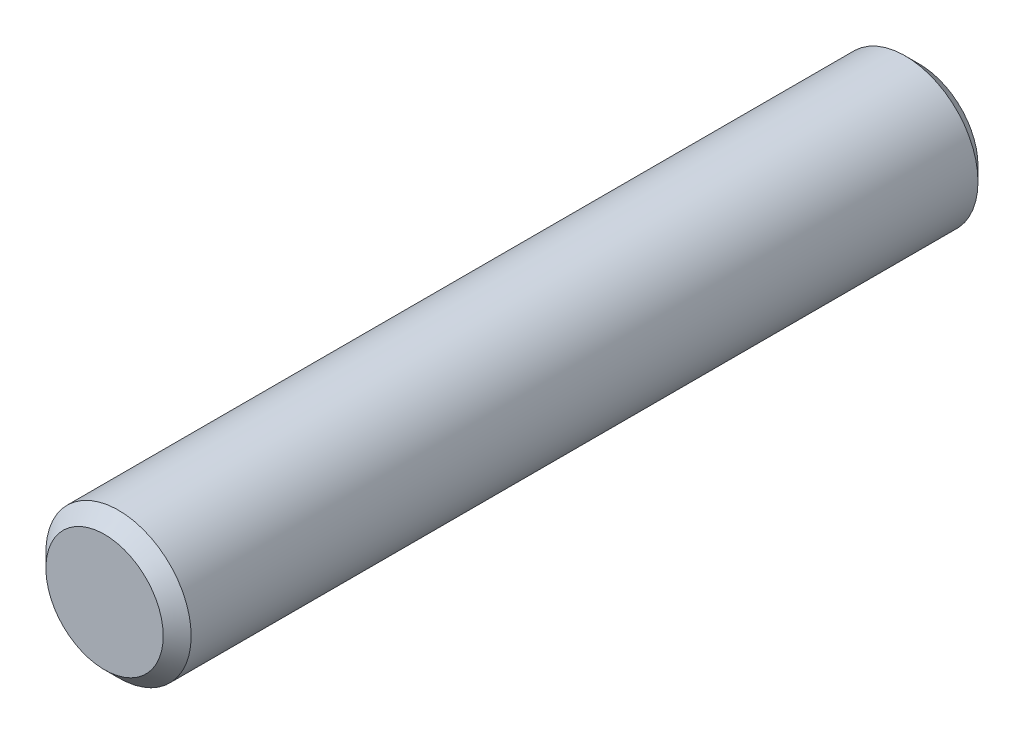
ISO-10303-21;
HEADER;
FILE_DESCRIPTION(('STEP AP214'),'2;1');
FILE_NAME('part.step','',(''),(''),'','','');
FILE_SCHEMA(('AUTOMOTIVE_DESIGN { 1 0 10303 214 1 1 1 1 }'));
ENDSEC;
DATA;
#1=APPLICATION_CONTEXT('core data for automotive mechanical design processes');
#2=APPLICATION_PROTOCOL_DEFINITION('international standard','automotive_design',2000,#1);
#3=PRODUCT_CONTEXT('',#1,'mechanical');
#4=PRODUCT('Part','Part','',(#3));
#5=PRODUCT_RELATED_PRODUCT_CATEGORY('part','',(#4));
#6=PRODUCT_DEFINITION_FORMATION('','',#4);
#7=PRODUCT_DEFINITION_CONTEXT('part definition',#1,'design');
#8=PRODUCT_DEFINITION('design','',#6,#7);
#9=PRODUCT_DEFINITION_SHAPE('','',#8);
#10=(LENGTH_UNIT() NAMED_UNIT(*) SI_UNIT(.MILLI.,.METRE.));
#11=(NAMED_UNIT(*) PLANE_ANGLE_UNIT() SI_UNIT($,.RADIAN.));
#12=(NAMED_UNIT(*) SI_UNIT($,.STERADIAN.) SOLID_ANGLE_UNIT());
#13=UNCERTAINTY_MEASURE_WITH_UNIT(LENGTH_MEASURE(1.E-05),#10,'distance_accuracy_value','');
#14=(GEOMETRIC_REPRESENTATION_CONTEXT(3) GLOBAL_UNCERTAINTY_ASSIGNED_CONTEXT((#13)) GLOBAL_UNIT_ASSIGNED_CONTEXT((#10,
#11,#12)) REPRESENTATION_CONTEXT('',''));
#15=CARTESIAN_POINT('',(0.,0.,0.));
#16=DIRECTION('',(0.,0.,1.));
#17=DIRECTION('',(1.,0.,0.));
#18=AXIS2_PLACEMENT_3D('',#15,#16,#17);
#19=CARTESIAN_POINT('',(0.,0.,11.1125));
#20=DIRECTION('',(0.,0.,-1.));
#21=DIRECTION('',(-1.,0.,0.));
#22=AXIS2_PLACEMENT_3D('',#19,#20,#21);
#23=CYLINDRICAL_SURFACE('',#22,1.9812);
#24=CARTESIAN_POINT('',(0.,0.,-10.7315));
#25=DIRECTION('',(0.,0.,1.));
#26=DIRECTION('',(1.,0.,0.));
#27=AXIS2_PLACEMENT_3D('',#24,#25,#26);
#28=CIRCLE('',#27,1.9812);
#29=CARTESIAN_POINT('',(1.9812,0.,-10.7315));
#30=VERTEX_POINT('',#29);
#31=EDGE_CURVE('E44',#30,#30,#28,.T.);
#32=ORIENTED_EDGE('',*,*,#31,.T.);
#33=EDGE_LOOP('',(#32));
#34=FACE_BOUND('',#33,.T.);
#35=CARTESIAN_POINT('',(0.,0.,10.7315));
#36=DIRECTION('',(0.,0.,1.));
#37=DIRECTION('',(1.,0.,0.));
#38=AXIS2_PLACEMENT_3D('',#35,#36,#37);
#39=CIRCLE('',#38,1.9812);
#40=CARTESIAN_POINT('',(1.9812,0.,10.7315));
#41=VERTEX_POINT('',#40);
#42=EDGE_CURVE('E48',#41,#41,#39,.F.);
#43=ORIENTED_EDGE('',*,*,#42,.T.);
#44=EDGE_LOOP('',(#43));
#45=FACE_BOUND('',#44,.T.);
#46=ADVANCED_FACE('F33',(#34,#45),#23,.T.);
#47=CARTESIAN_POINT('',(0.,0.,11.1125));
#48=DIRECTION('',(0.,0.,1.));
#49=DIRECTION('',(1.,0.,0.));
#50=AXIS2_PLACEMENT_3D('',#47,#48,#49);
#51=PLANE('',#50);
#52=CARTESIAN_POINT('',(0.,0.,11.1125));
#53=DIRECTION('',(0.,0.,1.));
#54=DIRECTION('',(1.,0.,0.));
#55=AXIS2_PLACEMENT_3D('',#52,#53,#54);
#56=CIRCLE('',#55,1.6002);
#57=CARTESIAN_POINT('',(1.6002,0.,11.1125));
#58=VERTEX_POINT('',#57);
#59=EDGE_CURVE('E10',#58,#58,#56,.T.);
#60=ORIENTED_EDGE('',*,*,#59,.T.);
#61=EDGE_LOOP('',(#60));
#62=FACE_BOUND('',#61,.T.);
#63=ADVANCED_FACE('F64',(#62),#51,.T.);
#64=CARTESIAN_POINT('',(0.,0.,-11.1125));
#65=DIRECTION('',(0.,0.,1.));
#66=DIRECTION('',(1.,0.,0.));
#67=AXIS2_PLACEMENT_3D('',#64,#65,#66);
#68=PLANE('',#67);
#69=CARTESIAN_POINT('',(0.,0.,-11.1125));
#70=DIRECTION('',(0.,0.,1.));
#71=DIRECTION('',(1.,0.,0.));
#72=AXIS2_PLACEMENT_3D('',#69,#70,#71);
#73=CIRCLE('',#72,1.60019999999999);
#74=CARTESIAN_POINT('',(1.60019999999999,0.,-11.1125));
#75=VERTEX_POINT('',#74);
#76=EDGE_CURVE('E40',#75,#75,#73,.F.);
#77=ORIENTED_EDGE('',*,*,#76,.T.);
#78=EDGE_LOOP('',(#77));
#79=FACE_BOUND('',#78,.T.);
#80=ADVANCED_FACE('F61',(#79),#68,.F.);
#81=CARTESIAN_POINT('',(0.,0.,-10.7315));
#82=DIRECTION('',(0.,0.,1.));
#83=DIRECTION('',(1.,0.,0.));
#84=AXIS2_PLACEMENT_3D('',#81,#82,#83);
#85=CONICAL_SURFACE('',#84,1.9812,0.785398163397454);
#86=ORIENTED_EDGE('',*,*,#76,.F.);
#87=EDGE_LOOP('',(#86));
#88=FACE_BOUND('',#87,.T.);
#89=ORIENTED_EDGE('',*,*,#31,.F.);
#90=EDGE_LOOP('',(#89));
#91=FACE_BOUND('',#90,.T.);
#92=ADVANCED_FACE('F57',(#88,#91),#85,.T.);
#93=CARTESIAN_POINT('',(0.,0.,11.1125));
#94=DIRECTION('',(0.,0.,-1.));
#95=DIRECTION('',(-1.,0.,0.));
#96=AXIS2_PLACEMENT_3D('',#93,#94,#95);
#97=CONICAL_SURFACE('',#96,1.6002,0.785398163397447);
#98=ORIENTED_EDGE('',*,*,#42,.F.);
#99=EDGE_LOOP('',(#98));
#100=FACE_BOUND('',#99,.T.);
#101=ORIENTED_EDGE('',*,*,#59,.F.);
#102=EDGE_LOOP('',(#101));
#103=FACE_BOUND('',#102,.T.);
#104=ADVANCED_FACE('F35',(#100,#103),#97,.T.);
#105=CLOSED_SHELL('',(#46,#63,#80,#92,#104));
#106=MANIFOLD_SOLID_BREP('B2',#105);
#107=ADVANCED_BREP_SHAPE_REPRESENTATION('',(#18,#106),#14);
#108=SHAPE_DEFINITION_REPRESENTATION(#9,#107);
ENDSEC;
END-ISO-10303-21;
